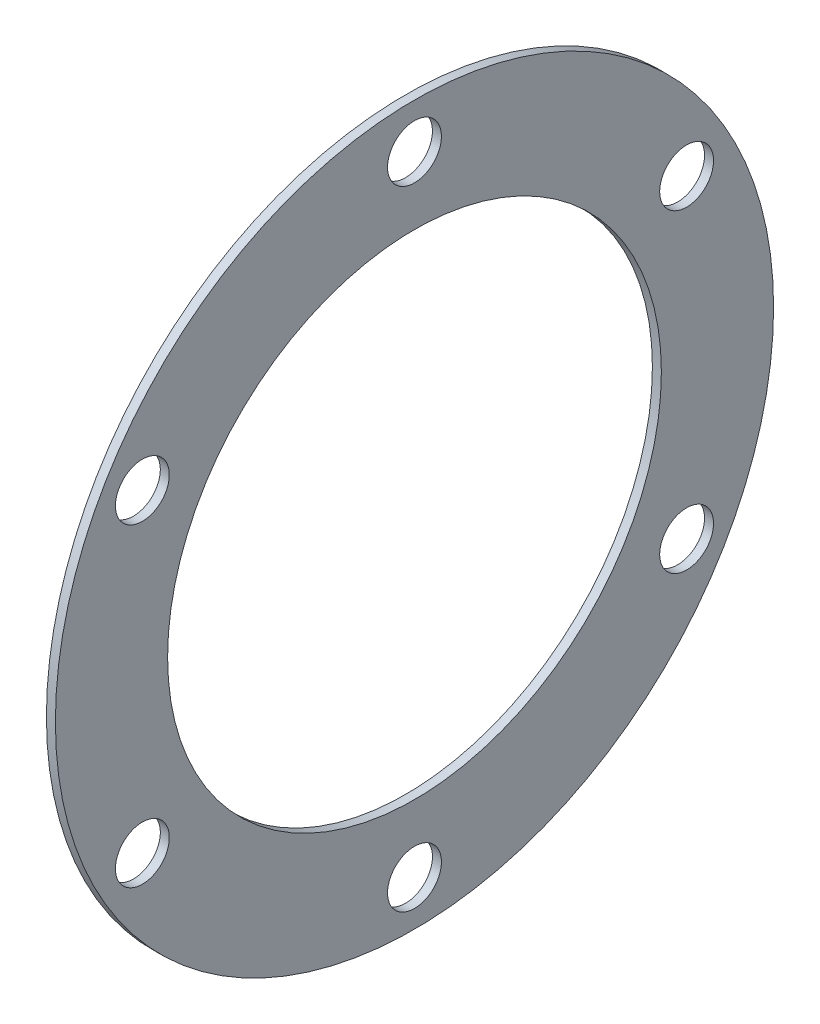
from build123d import *

# Parameters (mm, degrees)
SKETCH2_W          = 2
SKETCH2_H          = 80
CUT_EXTRUDE1_REACH = 115.155
SKETCH5_R          = 6
CUT_EXTRUDE2_REACH = 115.155
SKETCH6_R          = 55
CIRPATTERN2_COUNT  = 6


with BuildPart() as part:
    # Sketch2 → Revolve1 (revolve)
    with BuildSketch(Plane.XY, mode=Mode.PRIVATE) as revolve1_sk:
        with Locations((1, 40)):
            Rectangle(SKETCH2_W, SKETCH2_H)
    revolve(revolve1_sk.sketch.rotate(Axis((29.906992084, 0, 0), (-1, 0, 0)), 90), axis=Axis((29.906992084, 0, 0), (-1, 0, 0)))

    # Sketch5 → Cut-Extrude1 (cut, up to next)
    with BuildSketch(Plane.ZY, mode=Mode.PRIVATE) as cut_extrude1_sk1:
        with Locations((0, 70)):
            Circle(SKETCH5_R)
    cut_extrude1_tool1 = extrude(cut_extrude1_sk1.sketch, amount=-CUT_EXTRUDE1_REACH, mode=Mode.PRIVATE) & part.part
    cut_extrude1 = cut_extrude1_tool1.solids().sort_by_distance((0, 70, 0))[0]
    add(cut_extrude1, mode=Mode.SUBTRACT)

    # Sketch6 → Cut-Extrude2 (cut, up to next)
    with BuildSketch(Plane.ZY, mode=Mode.PRIVATE) as cut_extrude2_sk1:
        Circle(SKETCH6_R)
    cut_extrude2_tool1 = extrude(cut_extrude2_sk1.sketch, amount=-CUT_EXTRUDE2_REACH, mode=Mode.PRIVATE) & part.part
    add(cut_extrude2_tool1.solids().sort_by_distance((0, 0, 0))[0], mode=Mode.SUBTRACT)

    # CirPattern2: Cut-Extrude1 ×6 about axis
    cirpattern2_axis = Axis((0, 0, 0), (1, 0, 0))
    for i in range(1, CIRPATTERN2_COUNT):
        add(cut_extrude1.rotate(cirpattern2_axis, i * 360 / CIRPATTERN2_COUNT), mode=Mode.SUBTRACT)


solid = part.part
